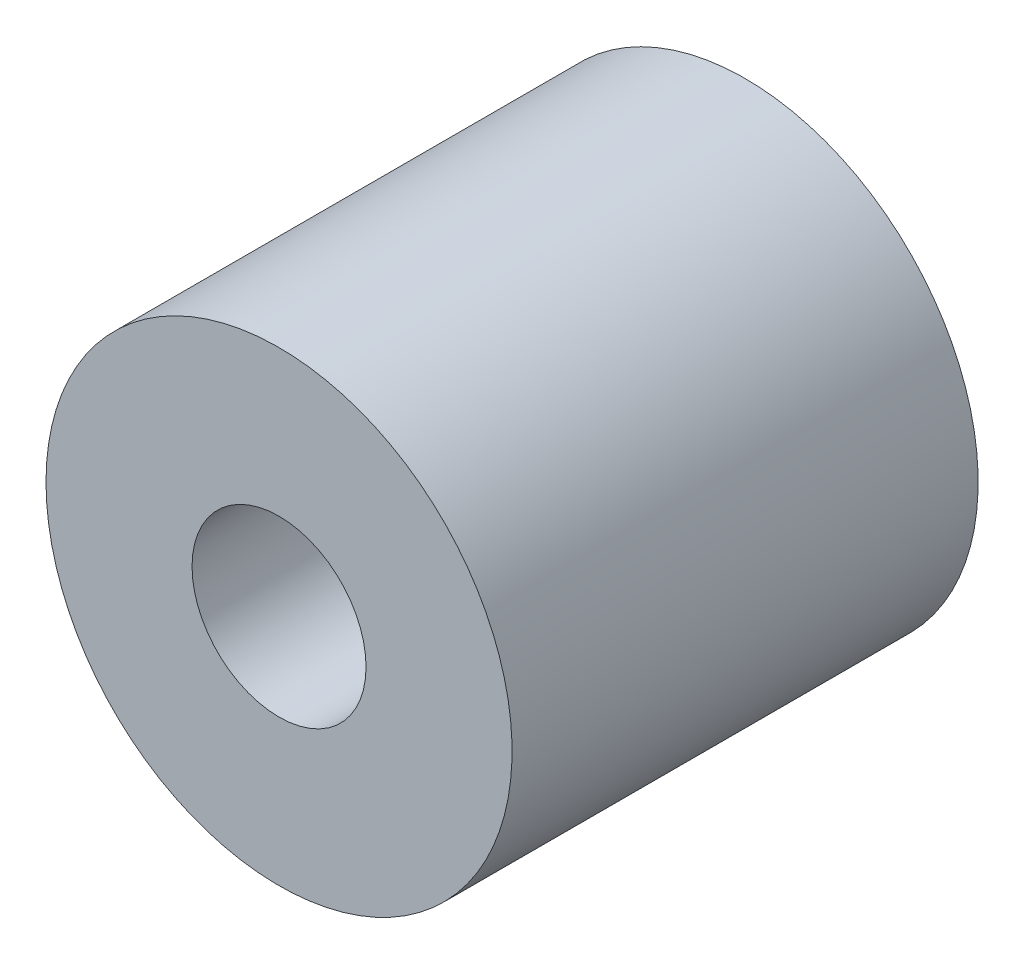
from build123d import *

# Parameters (mm, degrees)
SKETCH1_R      = 4.7625
SKETCH1_R_2    = 1.778
EXTRUDE1_DEPTH = 4.7625


with BuildPart() as part:
    # Sketch1 → Extrude1 (new, symmetric)
    with BuildSketch(Plane.XY):
        with Locations(Location((0, 0, 0), (0, 0, 180))):
            Circle(SKETCH1_R)
        with Locations(Location((0, 0, 0), (0, 0, 180))):
            Circle(SKETCH1_R_2, mode=Mode.SUBTRACT)
    extrude(amount=EXTRUDE1_DEPTH, both=True)


solid = part.part
